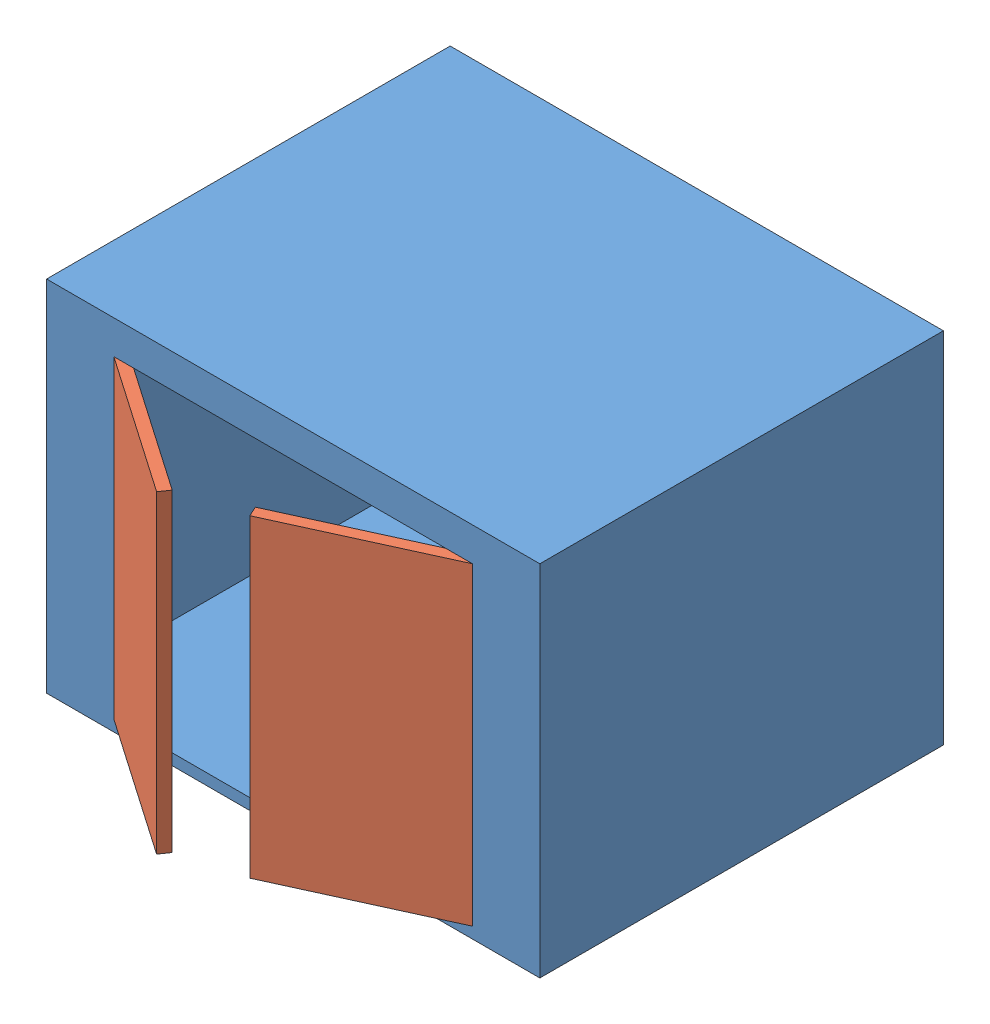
SolidWorks assembly Doors.SLDASM, configuration Default (file format 3400). Lengths in mm.
Overall size (558.8 406.4 565.48).
3 component instances, 2 part files, 4 mates.
Components (placement in the parent):
- Box-1: Box.SLDPRT [Default] at origin size (558.8 406.4 457.2)
- Door-1: Door.SLDPRT [Default] at (-195.9813 12.7 -10.449) x (0.822753 0 0.568399) z (-0.568399 0 0.822753) size (190.5 355.6 12.7)
- Door-2: Door.SLDPRT [Default] at (24.5958 12.7 67.469) x (0.9099 0 -0.414828) z (0.414828 0 0.9099) size (190.5 355.6 12.7)
Mates (geometry in assembly coordinates):
- Coincident1: coincident aligned: line of Box-1; line of Door-1
- Coincident2: coincident anti-aligned: plane of Box-1 through (-279.4 12.7 -457.2) normal (0 1 0); plane of Door-1 through (-203.2 12.7 0) normal (0 -1 0)
- Coincident3: coincident aligned: line of Box-1; line of Door-2
- Coincident4: coincident anti-aligned: plane of Box-1 through (-279.4 12.7 -457.2) normal (0 1 0); plane of Door-2 through (29.8641 12.7 79.0247) normal (0 -1 0)
